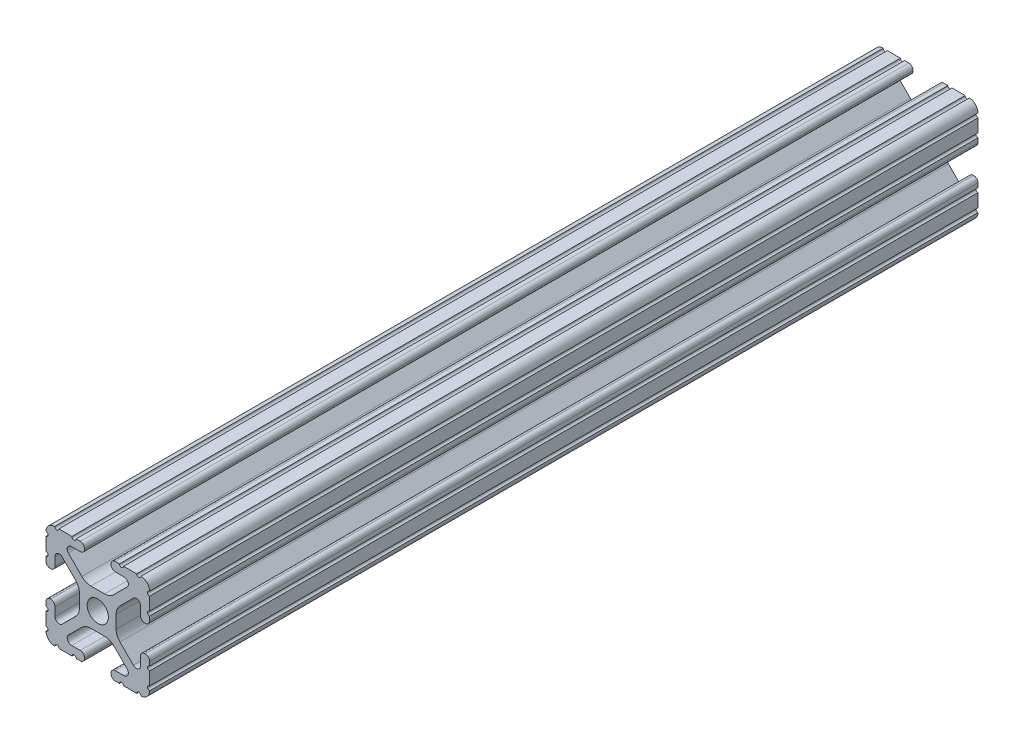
from build123d import *

# Parameters (mm, degrees)
SKETCH1_R           = 2.6035
BOSS_EXTRUDE1_DEPTH = 101.6


with BuildPart() as part:
    # Sketch1 → Boss-Extrude1 (new, symmetric)
    with BuildSketch(Plane.XY):
        with BuildLine():
            Line((-7.179650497, -8.645192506), (-3.952270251, -5.423690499))
            ThreePointArc((-3.952270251, -5.423690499), (-2.922936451, -4.736929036), (-1.709253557, -4.4958))
            Line((-1.709253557, -4.4958), (1.709253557, -4.4958))
            ThreePointArc((1.709253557, -4.4958), (2.922936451, -4.736929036), (3.952270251, -5.423690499))
            Line((3.952270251, -5.423690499), (7.179650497, -8.645192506))
            ThreePointArc((7.179650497, -8.645192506), (7.41473083, -9.822813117), (6.416408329, -10.4902))
            Line((6.416408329, -10.4902), (4.287512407, -10.4902))
            ThreePointArc((4.287512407, -10.4902), (3.54574862, -10.79744862), (3.2385, -11.539212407))
            Line((3.2385, -11.539212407), (3.2385, -11.650987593))
            ThreePointArc((3.2385, -11.650987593), (3.54574862, -12.39275138), (4.287512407, -12.7))
            Line((4.287512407, -12.7), (5.317126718, -12.7))
            ThreePointArc((5.317126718, -12.7), (5.825126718, -12.192), (6.333126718, -12.7))
            Line((6.333126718, -12.7), (9.550443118, -12.7))
            ThreePointArc((9.550443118, -12.7), (10.058366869, -12.192000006), (10.566443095, -12.699847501))
            ThreePointArc((10.566443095, -12.699847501), (12.082537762, -12.08250727), (12.699846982, -10.566399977))
            ThreePointArc((12.699846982, -10.566399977), (12.192000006, -10.058323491), (12.7, -9.5504))
            Line((12.7, -9.5504), (12.7, -6.3330836))
            ThreePointArc((12.7, -6.3330836), (12.192, -5.8250836), (12.7, -5.3170836))
            Line((12.7, -5.3170836), (12.7, -4.287469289))
            ThreePointArc((12.7, -4.287469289), (12.39275138, -3.545705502), (11.650987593, -3.238456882))
            Line((11.650987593, -3.238456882), (11.539212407, -3.238456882))
            ThreePointArc((11.539212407, -3.238456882), (10.79744862, -3.545705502), (10.4902, -4.287469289))
            Line((10.4902, -4.287469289), (10.4902, -6.402089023))
            ThreePointArc((10.4902, -6.402089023), (9.856505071, -7.351067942), (8.737131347, -7.129408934))
            Line((8.737131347, -7.129408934), (5.441005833, -3.840816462))
            ThreePointArc((5.441005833, -3.840816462), (4.750877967, -2.809883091), (4.5085, -1.593185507))
            Line((4.5085, -1.593185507), (4.5085, 1.593185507))
            ThreePointArc((4.5085, 1.593185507), (4.750877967, 2.809883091), (5.441005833, 3.840816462))
            Line((5.441005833, 3.840816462), (8.737131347, 7.129408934))
            ThreePointArc((8.737131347, 7.129408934), (9.856505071, 7.351067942), (10.4902, 6.402089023))
            Line((10.4902, 6.402089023), (10.4902, 4.287469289))
            ThreePointArc((10.4902, 4.287469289), (10.79744862, 3.545705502), (11.539212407, 3.238456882))
            Line((11.539212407, 3.238456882), (11.650987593, 3.238456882))
            ThreePointArc((11.650987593, 3.238456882), (12.39275138, 3.545705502), (12.7, 4.287469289))
            Line((12.7, 4.287469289), (12.7, 5.3170836))
            ThreePointArc((12.7, 5.3170836), (12.192, 5.8250836), (12.7, 6.3330836))
            Line((12.7, 6.3330836), (12.7, 9.5504))
            ThreePointArc((12.7, 9.5504), (12.192000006, 10.058323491), (12.699846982, 10.566399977))
            ThreePointArc((12.699846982, 10.566399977), (12.082537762, 12.08250727), (10.566443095, 12.699847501))
            ThreePointArc((10.566443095, 12.699847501), (10.058366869, 12.192000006), (9.550443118, 12.7))
            Line((9.550443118, 12.7), (6.333126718, 12.7))
            ThreePointArc((6.333126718, 12.7), (5.825126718, 12.192), (5.317126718, 12.7))
            Line((5.317126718, 12.7), (4.287512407, 12.7))
            ThreePointArc((4.287512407, 12.7), (3.54574862, 12.39275138), (3.2385, 11.650987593))
            Line((3.2385, 11.650987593), (3.2385, 11.539212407))
            ThreePointArc((3.2385, 11.539212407), (3.54574862, 10.79744862), (4.287512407, 10.4902))
            Line((4.287512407, 10.4902), (6.476788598, 10.4902))
            ThreePointArc((6.476788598, 10.4902), (7.432222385, 9.85140422), (7.207036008, 8.724370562))
            Line((7.207036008, 8.724370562), (3.898272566, 5.423169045))
            ThreePointArc((3.898272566, 5.423169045), (2.869120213, 4.736787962), (1.655778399, 4.4958))
            Line((1.655778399, 4.4958), (-1.655778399, 4.4958))
            ThreePointArc((-1.655778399, 4.4958), (-2.869120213, 4.736787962), (-3.898272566, 5.423169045))
            Line((-3.898272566, 5.423169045), (-7.207036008, 8.724370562))
            ThreePointArc((-7.207036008, 8.724370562), (-7.432222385, 9.85140422), (-6.476788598, 10.4902))
            Line((-6.476788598, 10.4902), (-4.287512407, 10.4902))
            ThreePointArc((-4.287512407, 10.4902), (-3.54574862, 10.79744862), (-3.2385, 11.539212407))
            Line((-3.2385, 11.539212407), (-3.2385, 11.650987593))
            ThreePointArc((-3.2385, 11.650987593), (-3.54574862, 12.39275138), (-4.287512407, 12.7))
            Line((-4.287512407, 12.7), (-5.317126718, 12.7))
            ThreePointArc((-5.317126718, 12.7), (-5.825126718, 12.192), (-6.333126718, 12.7))
            Line((-6.333126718, 12.7), (-9.550443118, 12.7))
            ThreePointArc((-9.550443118, 12.7), (-10.058366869, 12.192000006), (-10.566443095, 12.699847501))
            ThreePointArc((-10.566443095, 12.699847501), (-12.082537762, 12.08250727), (-12.699846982, 10.566399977))
            ThreePointArc((-12.699846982, 10.566399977), (-12.192000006, 10.058323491), (-12.7, 9.5504))
            Line((-12.7, 9.5504), (-12.7, 6.3330836))
            ThreePointArc((-12.7, 6.3330836), (-12.192, 5.8250836), (-12.7, 5.3170836))
            Line((-12.7, 5.3170836), (-12.7, 4.287469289))
            ThreePointArc((-12.7, 4.287469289), (-12.39275138, 3.545705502), (-11.650987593, 3.238456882))
            Line((-11.650987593, 3.238456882), (-11.539212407, 3.238456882))
            ThreePointArc((-11.539212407, 3.238456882), (-10.79744862, 3.545705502), (-10.4902, 4.287469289))
            Line((-10.4902, 4.287469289), (-10.4902, 6.402089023))
            ThreePointArc((-10.4902, 6.402089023), (-9.856505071, 7.351067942), (-8.737131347, 7.129408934))
            Line((-8.737131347, 7.129408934), (-5.441005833, 3.840816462))
            ThreePointArc((-5.441005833, 3.840816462), (-4.750877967, 2.809883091), (-4.5085, 1.593185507))
            Line((-4.5085, 1.593185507), (-4.5085, -1.593185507))
            ThreePointArc((-4.5085, -1.593185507), (-4.750877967, -2.809883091), (-5.441005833, -3.840816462))
            Line((-5.441005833, -3.840816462), (-8.737131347, -7.129408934))
            ThreePointArc((-8.737131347, -7.129408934), (-9.856505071, -7.351067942), (-10.4902, -6.402089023))
            Line((-10.4902, -6.402089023), (-10.4902, -4.287469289))
            ThreePointArc((-10.4902, -4.287469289), (-10.79744862, -3.545705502), (-11.539212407, -3.238456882))
            Line((-11.539212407, -3.238456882), (-11.650987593, -3.238456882))
            ThreePointArc((-11.650987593, -3.238456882), (-12.39275138, -3.545705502), (-12.7, -4.287469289))
            Line((-12.7, -4.287469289), (-12.7, -5.3170836))
            ThreePointArc((-12.7, -5.3170836), (-12.192, -5.8250836), (-12.7, -6.3330836))
            Line((-12.7, -6.3330836), (-12.7, -9.5504))
            ThreePointArc((-12.7, -9.5504), (-12.192000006, -10.058323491), (-12.699846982, -10.566399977))
            ThreePointArc((-12.699846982, -10.566399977), (-12.082537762, -12.08250727), (-10.566443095, -12.699847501))
            ThreePointArc((-10.566443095, -12.699847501), (-10.058366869, -12.192000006), (-9.550443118, -12.7))
            Line((-9.550443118, -12.7), (-6.333126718, -12.7))
            ThreePointArc((-6.333126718, -12.7), (-5.825126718, -12.192), (-5.317126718, -12.7))
            Line((-5.317126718, -12.7), (-4.287512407, -12.7))
            ThreePointArc((-4.287512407, -12.7), (-3.54574862, -12.39275138), (-3.2385, -11.650987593))
            Line((-3.2385, -11.650987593), (-3.2385, -11.539212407))
            ThreePointArc((-3.2385, -11.539212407), (-3.54574862, -10.79744862), (-4.287512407, -10.4902))
            Line((-4.287512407, -10.4902), (-6.416408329, -10.4902))
            ThreePointArc((-6.416408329, -10.4902), (-7.41473083, -9.822813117), (-7.179650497, -8.645192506))
        make_face()
        Circle(SKETCH1_R, mode=Mode.SUBTRACT)
    extrude(amount=BOSS_EXTRUDE1_DEPTH, both=True)


solid = part.part
